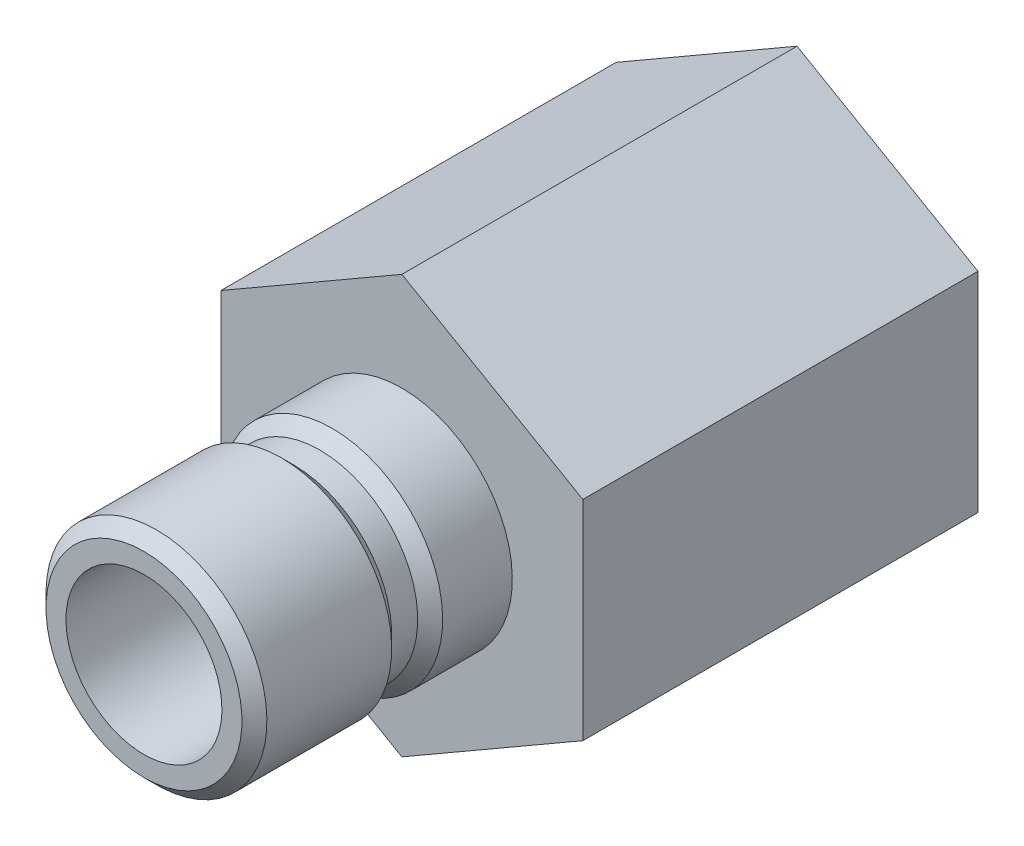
from build123d import *

# Parameters (mm, degrees)
SKETCH2_OUTSIDE_W  = 39.526
SKETCH2_OUTSIDE_H  = 39.526
CUT_EXTRUDE1_DEPTH = 31.5809882


with BuildPart() as part:
    # Sketch1 → Revolve1 (revolve)
    with BuildSketch(Plane(origin=(0, 0, 0), x_dir=(0, 0, -1), z_dir=(1, 0, 0))):
        Polygon((-15.748, 4.7625), (-15.748, 5.9817), (-14.986, 6.7437), (-7.366, 6.7437), (-6.604, 5.9817), (-5.0165, 5.9817), (-4.2545, 6.7437), (0, 6.7437), (0, 13.2842), (24.13, 13.2842), (24.13, 9.401569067), (8.9789, 8.9281), (8.9789, 4.7625), align=None)
    revolve(axis=Axis((0, 0, 0), (0, 0, 1)))

    # Sketch2 outside → Cut-Extrude1 (cut, through all)
    with BuildSketch(Plane.XY):
        Rectangle(SKETCH2_OUTSIDE_W, SKETCH2_OUTSIDE_H)
        Polygon((-11.049, 6.379143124), (-11.049, -6.379143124), (0, -12.758286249), (11.049, -6.379143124), (11.049, 6.379143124), (0, 12.758286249), align=None, mode=Mode.SUBTRACT)
    extrude(amount=-CUT_EXTRUDE1_DEPTH, mode=Mode.SUBTRACT)


solid = part.part
